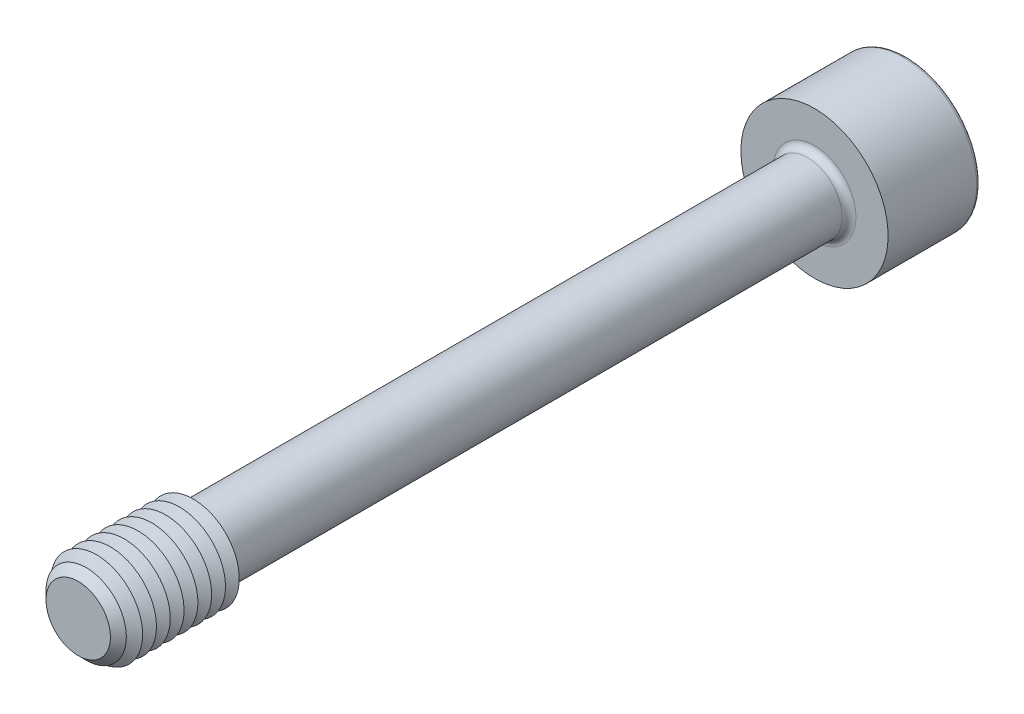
ISO-10303-21;
HEADER;
FILE_DESCRIPTION(('STEP AP214'),'2;1');
FILE_NAME('part.step','',(''),(''),'','','');
FILE_SCHEMA(('AUTOMOTIVE_DESIGN { 1 0 10303 214 1 1 1 1 }'));
ENDSEC;
DATA;
#1=APPLICATION_CONTEXT('core data for automotive mechanical design processes');
#2=APPLICATION_PROTOCOL_DEFINITION('international standard','automotive_design',2000,#1);
#3=PRODUCT_CONTEXT('',#1,'mechanical');
#4=PRODUCT('Part','Part','',(#3));
#5=PRODUCT_RELATED_PRODUCT_CATEGORY('part','',(#4));
#6=PRODUCT_DEFINITION_FORMATION('','',#4);
#7=PRODUCT_DEFINITION_CONTEXT('part definition',#1,'design');
#8=PRODUCT_DEFINITION('design','',#6,#7);
#9=PRODUCT_DEFINITION_SHAPE('','',#8);
#10=(LENGTH_UNIT() NAMED_UNIT(*) SI_UNIT(.MILLI.,.METRE.));
#11=(NAMED_UNIT(*) PLANE_ANGLE_UNIT() SI_UNIT($,.RADIAN.));
#12=(NAMED_UNIT(*) SI_UNIT($,.STERADIAN.) SOLID_ANGLE_UNIT());
#13=UNCERTAINTY_MEASURE_WITH_UNIT(LENGTH_MEASURE(1.E-05),#10,'distance_accuracy_value','');
#14=(GEOMETRIC_REPRESENTATION_CONTEXT(3) GLOBAL_UNCERTAINTY_ASSIGNED_CONTEXT((#13)) GLOBAL_UNIT_ASSIGNED_CONTEXT((#10,
#11,#12)) REPRESENTATION_CONTEXT('',''));
#15=CARTESIAN_POINT('',(0.,0.,0.));
#16=DIRECTION('',(0.,0.,1.));
#17=DIRECTION('',(1.,0.,0.));
#18=AXIS2_PLACEMENT_3D('',#15,#16,#17);
#19=CARTESIAN_POINT('',(-2.3094010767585,-4.,-42.));
#20=DIRECTION('',(0.,0.,1.));
#21=DIRECTION('',(1.,0.,0.));
#22=AXIS2_PLACEMENT_3D('',#19,#20,#21);
#23=PLANE('',#22);
#24=DIRECTION('',(1.,0.,0.));
#25=VECTOR('',#24,1.);
#26=CARTESIAN_POINT('',(-2.3094010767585,-4.,-42.));
#27=LINE('',#26,#25);
#28=CARTESIAN_POINT('',(0.,-4.,-42.));
#29=VERTEX_POINT('',#28);
#30=CARTESIAN_POINT('',(2.3094010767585,-4.,-42.));
#31=VERTEX_POINT('',#30);
#32=EDGE_CURVE('E762',#29,#31,#27,.T.);
#33=ORIENTED_EDGE('',*,*,#32,.F.);
#34=CARTESIAN_POINT('',(0.,0.,-42.));
#35=DIRECTION('',(0.,0.,1.));
#36=DIRECTION('',(0.,-1.,0.));
#37=AXIS2_PLACEMENT_3D('',#34,#35,#36);
#38=CIRCLE('',#37,4.);
#39=CARTESIAN_POINT('',(3.46410161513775,-2.,-42.));
#40=VERTEX_POINT('',#39);
#41=EDGE_CURVE('E53',#29,#40,#38,.T.);
#42=ORIENTED_EDGE('',*,*,#41,.T.);
#43=DIRECTION('',(0.5,0.866025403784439,0.));
#44=VECTOR('',#43,1.);
#45=CARTESIAN_POINT('',(2.3094010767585,-4.,-42.));
#46=LINE('',#45,#44);
#47=EDGE_CURVE('E746',#31,#40,#46,.T.);
#48=ORIENTED_EDGE('',*,*,#47,.F.);
#49=EDGE_LOOP('',(#33,#42,#48));
#50=FACE_BOUND('',#49,.T.);
#51=ADVANCED_FACE('F41',(#50),#23,.F.);
#52=CARTESIAN_POINT('',(4.618802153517,0.,-42.));
#53=VERTEX_POINT('',#52);
#54=EDGE_CURVE('E758',#40,#53,#46,.T.);
#55=ORIENTED_EDGE('',*,*,#54,.F.);
#56=CARTESIAN_POINT('',(3.46410161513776,2.,-42.));
#57=VERTEX_POINT('',#56);
#58=EDGE_CURVE('E11',#40,#57,#38,.T.);
#59=ORIENTED_EDGE('',*,*,#58,.T.);
#60=DIRECTION('',(-0.5,0.866025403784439,0.));
#61=VECTOR('',#60,1.);
#62=CARTESIAN_POINT('',(4.618802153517,0.,-42.));
#63=LINE('',#62,#61);
#64=EDGE_CURVE('E745',#53,#57,#63,.T.);
#65=ORIENTED_EDGE('',*,*,#64,.F.);
#66=EDGE_LOOP('',(#55,#59,#65));
#67=FACE_BOUND('',#66,.T.);
#68=ADVANCED_FACE('F133',(#67),#23,.F.);
#69=CARTESIAN_POINT('',(2.3094010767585,4.,-42.));
#70=VERTEX_POINT('',#69);
#71=EDGE_CURVE('E740',#57,#70,#63,.T.);
#72=ORIENTED_EDGE('',*,*,#71,.F.);
#73=CARTESIAN_POINT('',(0.,4.,-42.));
#74=VERTEX_POINT('',#73);
#75=EDGE_CURVE('E51',#57,#74,#38,.T.);
#76=ORIENTED_EDGE('',*,*,#75,.T.);
#77=DIRECTION('',(-1.,0.,0.));
#78=VECTOR('',#77,1.);
#79=CARTESIAN_POINT('',(2.3094010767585,4.,-42.));
#80=LINE('',#79,#78);
#81=EDGE_CURVE('E177',#70,#74,#80,.T.);
#82=ORIENTED_EDGE('',*,*,#81,.F.);
#83=EDGE_LOOP('',(#72,#76,#82));
#84=FACE_BOUND('',#83,.T.);
#85=ADVANCED_FACE('F139',(#84),#23,.F.);
#86=CARTESIAN_POINT('',(-2.3094010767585,4.,-42.));
#87=VERTEX_POINT('',#86);
#88=EDGE_CURVE('E751',#74,#87,#80,.T.);
#89=ORIENTED_EDGE('',*,*,#88,.F.);
#90=CARTESIAN_POINT('',(-3.46410161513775,2.,-42.));
#91=VERTEX_POINT('',#90);
#92=EDGE_CURVE('E262',#74,#91,#38,.T.);
#93=ORIENTED_EDGE('',*,*,#92,.T.);
#94=DIRECTION('',(-0.500000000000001,-0.866025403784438,0.));
#95=VECTOR('',#94,1.);
#96=CARTESIAN_POINT('',(-2.3094010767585,4.,-42.));
#97=LINE('',#96,#95);
#98=EDGE_CURVE('E176',#87,#91,#97,.T.);
#99=ORIENTED_EDGE('',*,*,#98,.F.);
#100=EDGE_LOOP('',(#89,#93,#99));
#101=FACE_BOUND('',#100,.T.);
#102=ADVANCED_FACE('F157',(#101),#23,.F.);
#103=CARTESIAN_POINT('',(-4.61880215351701,0.,-42.));
#104=VERTEX_POINT('',#103);
#105=EDGE_CURVE('E170',#91,#104,#97,.T.);
#106=ORIENTED_EDGE('',*,*,#105,.F.);
#107=CARTESIAN_POINT('',(-3.46410161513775,-2.,-42.));
#108=VERTEX_POINT('',#107);
#109=EDGE_CURVE('E172',#91,#108,#38,.T.);
#110=ORIENTED_EDGE('',*,*,#109,.T.);
#111=DIRECTION('',(0.5,-0.866025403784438,0.));
#112=VECTOR('',#111,1.);
#113=CARTESIAN_POINT('',(-4.61880215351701,0.,-42.));
#114=LINE('',#113,#112);
#115=EDGE_CURVE('E174',#104,#108,#114,.T.);
#116=ORIENTED_EDGE('',*,*,#115,.F.);
#117=EDGE_LOOP('',(#106,#110,#116));
#118=FACE_BOUND('',#117,.T.);
#119=ADVANCED_FACE('F146',(#118),#23,.F.);
#120=CARTESIAN_POINT('',(0.,0.,-50.));
#121=DIRECTION('',(0.,0.,-1.));
#122=DIRECTION('',(-1.,0.,0.));
#123=AXIS2_PLACEMENT_3D('',#120,#121,#122);
#124=PLANE('',#123);
#125=CARTESIAN_POINT('',(0.,0.,-50.));
#126=DIRECTION('',(0.,0.,-1.));
#127=DIRECTION('',(-1.,0.,0.));
#128=AXIS2_PLACEMENT_3D('',#125,#126,#127);
#129=CIRCLE('',#128,7.625);
#130=CARTESIAN_POINT('',(-7.625,0.,-50.));
#131=VERTEX_POINT('',#130);
#132=EDGE_CURVE('E250',#131,#131,#129,.T.);
#133=ORIENTED_EDGE('',*,*,#132,.T.);
#134=EDGE_LOOP('',(#133));
#135=FACE_BOUND('',#134,.T.);
#136=DIRECTION('',(-0.500000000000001,-0.866025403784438,0.));
#137=VECTOR('',#136,1.);
#138=CARTESIAN_POINT('',(-2.3094010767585,4.,-50.));
#139=LINE('',#138,#137);
#140=CARTESIAN_POINT('',(-2.3094010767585,4.,-50.));
#141=VERTEX_POINT('',#140);
#142=CARTESIAN_POINT('',(-4.61880215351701,0.,-50.));
#143=VERTEX_POINT('',#142);
#144=EDGE_CURVE('E211',#141,#143,#139,.T.);
#145=ORIENTED_EDGE('',*,*,#144,.T.);
#146=DIRECTION('',(0.5,-0.866025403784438,0.));
#147=VECTOR('',#146,1.);
#148=CARTESIAN_POINT('',(-4.61880215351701,0.,-50.));
#149=LINE('',#148,#147);
#150=CARTESIAN_POINT('',(-2.3094010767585,-4.,-50.));
#151=VERTEX_POINT('',#150);
#152=EDGE_CURVE('E67',#143,#151,#149,.T.);
#153=ORIENTED_EDGE('',*,*,#152,.T.);
#154=DIRECTION('',(1.,0.,0.));
#155=VECTOR('',#154,1.);
#156=CARTESIAN_POINT('',(-2.3094010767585,-4.,-50.));
#157=LINE('',#156,#155);
#158=CARTESIAN_POINT('',(2.3094010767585,-4.,-50.));
#159=VERTEX_POINT('',#158);
#160=EDGE_CURVE('E196',#151,#159,#157,.T.);
#161=ORIENTED_EDGE('',*,*,#160,.T.);
#162=DIRECTION('',(0.5,0.866025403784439,0.));
#163=VECTOR('',#162,1.);
#164=CARTESIAN_POINT('',(2.3094010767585,-4.,-50.));
#165=LINE('',#164,#163);
#166=CARTESIAN_POINT('',(4.618802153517,0.,-50.));
#167=VERTEX_POINT('',#166);
#168=EDGE_CURVE('E200',#159,#167,#165,.T.);
#169=ORIENTED_EDGE('',*,*,#168,.T.);
#170=DIRECTION('',(-0.5,0.866025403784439,0.));
#171=VECTOR('',#170,1.);
#172=CARTESIAN_POINT('',(4.618802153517,0.,-50.));
#173=LINE('',#172,#171);
#174=CARTESIAN_POINT('',(2.3094010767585,4.,-50.));
#175=VERTEX_POINT('',#174);
#176=EDGE_CURVE('E204',#167,#175,#173,.T.);
#177=ORIENTED_EDGE('',*,*,#176,.T.);
#178=DIRECTION('',(-1.,0.,0.));
#179=VECTOR('',#178,1.);
#180=CARTESIAN_POINT('',(2.3094010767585,4.,-50.));
#181=LINE('',#180,#179);
#182=EDGE_CURVE('E207',#175,#141,#181,.T.);
#183=ORIENTED_EDGE('',*,*,#182,.T.);
#184=EDGE_LOOP('',(#145,#153,#161,#169,#177,#183));
#185=FACE_BOUND('',#184,.T.);
#186=ADVANCED_FACE('F156',(#135,#185),#124,.T.);
#187=CARTESIAN_POINT('',(0.,0.,40.));
#188=DIRECTION('',(0.,0.,-1.));
#189=DIRECTION('',(-1.,0.,0.));
#190=AXIS2_PLACEMENT_3D('',#187,#188,#189);
#191=CYLINDRICAL_SURFACE('',#190,3.75);
#192=CARTESIAN_POINT('',(0.,0.,-39.25));
#193=DIRECTION('',(0.,0.,-1.));
#194=DIRECTION('',(-1.,0.,0.));
#195=AXIS2_PLACEMENT_3D('',#192,#193,#194);
#196=CIRCLE('',#195,3.75);
#197=CARTESIAN_POINT('',(-3.75,0.,-39.25));
#198=VERTEX_POINT('',#197);
#199=EDGE_CURVE('E246',#198,#198,#196,.F.);
#200=ORIENTED_EDGE('',*,*,#199,.T.);
#201=EDGE_LOOP('',(#200));
#202=FACE_BOUND('',#201,.T.);
#203=CARTESIAN_POINT('',(0.,0.,26.778312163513));
#204=DIRECTION('',(0.,0.,-1.));
#205=DIRECTION('',(0.,1.,0.));
#206=AXIS2_PLACEMENT_3D('',#203,#204,#205);
#207=CIRCLE('',#206,3.75);
#208=CARTESIAN_POINT('',(0.,3.75,26.778312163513));
#209=VERTEX_POINT('',#208);
#210=EDGE_CURVE('E234',#209,#209,#207,.T.);
#211=ORIENTED_EDGE('',*,*,#210,.T.);
#212=EDGE_LOOP('',(#211));
#213=FACE_BOUND('',#212,.T.);
#214=ADVANCED_FACE('F163',(#202,#213),#191,.T.);
#215=CARTESIAN_POINT('',(0.,0.,26.778312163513));
#216=DIRECTION('',(0.,0.,1.));
#217=DIRECTION('',(0.,-1.,0.));
#218=AXIS2_PLACEMENT_3D('',#215,#216,#217);
#219=CONICAL_SURFACE('',#218,3.75,1.0471975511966);
#220=CARTESIAN_POINT('',(0.,0.,27.5));
#221=DIRECTION('',(0.,0.,-1.));
#222=DIRECTION('',(-1.,0.,0.));
#223=AXIS2_PLACEMENT_3D('',#220,#221,#222);
#224=CIRCLE('',#223,5.);
#225=CARTESIAN_POINT('',(-5.,0.,27.5));
#226=VERTEX_POINT('',#225);
#227=EDGE_CURVE('E266',#226,#226,#224,.T.);
#228=ORIENTED_EDGE('',*,*,#227,.T.);
#229=EDGE_LOOP('',(#228));
#230=FACE_BOUND('',#229,.T.);
#231=ORIENTED_EDGE('',*,*,#210,.F.);
#232=EDGE_LOOP('',(#231));
#233=FACE_BOUND('',#232,.T.);
#234=ADVANCED_FACE('F509',(#230,#233),#219,.T.);
#235=CARTESIAN_POINT('',(0.,0.,-40.));
#236=DIRECTION('',(0.,0.,-1.));
#237=DIRECTION('',(-1.,0.,0.));
#238=AXIS2_PLACEMENT_3D('',#235,#236,#237);
#239=PLANE('',#238);
#240=CARTESIAN_POINT('',(0.,0.,-40.));
#241=DIRECTION('',(0.,0.,-1.));
#242=DIRECTION('',(-1.,0.,0.));
#243=AXIS2_PLACEMENT_3D('',#240,#241,#242);
#244=CIRCLE('',#243,4.5);
#245=CARTESIAN_POINT('',(-4.5,0.,-40.));
#246=VERTEX_POINT('',#245);
#247=EDGE_CURVE('E242',#246,#246,#244,.T.);
#248=ORIENTED_EDGE('',*,*,#247,.T.);
#249=EDGE_LOOP('',(#248));
#250=FACE_BOUND('',#249,.T.);
#251=CARTESIAN_POINT('',(0.,0.,-40.));
#252=DIRECTION('',(0.,0.,-1.));
#253=DIRECTION('',(-1.,0.,0.));
#254=AXIS2_PLACEMENT_3D('',#251,#252,#253);
#255=CIRCLE('',#254,8.);
#256=CARTESIAN_POINT('',(-8.,0.,-40.));
#257=VERTEX_POINT('',#256);
#258=EDGE_CURVE('E230',#257,#257,#255,.T.);
#259=ORIENTED_EDGE('',*,*,#258,.F.);
#260=EDGE_LOOP('',(#259));
#261=FACE_BOUND('',#260,.T.);
#262=ADVANCED_FACE('F502',(#250,#261),#239,.F.);
#263=CARTESIAN_POINT('',(0.,0.,-50.));
#264=DIRECTION('',(0.,0.,1.));
#265=DIRECTION('',(1.,0.,0.));
#266=AXIS2_PLACEMENT_3D('',#263,#264,#265);
#267=CYLINDRICAL_SURFACE('',#266,8.);
#268=CARTESIAN_POINT('',(0.,0.,-49.625));
#269=DIRECTION('',(0.,0.,-1.));
#270=DIRECTION('',(-1.,0.,0.));
#271=AXIS2_PLACEMENT_3D('',#268,#269,#270);
#272=CIRCLE('',#271,8.);
#273=CARTESIAN_POINT('',(-8.,0.,-49.625));
#274=VERTEX_POINT('',#273);
#275=EDGE_CURVE('E252',#274,#274,#272,.F.);
#276=ORIENTED_EDGE('',*,*,#275,.T.);
#277=EDGE_LOOP('',(#276));
#278=FACE_BOUND('',#277,.T.);
#279=ORIENTED_EDGE('',*,*,#258,.T.);
#280=EDGE_LOOP('',(#279));
#281=FACE_BOUND('',#280,.T.);
#282=ADVANCED_FACE('F508',(#278,#281),#267,.T.);
#283=CARTESIAN_POINT('',(-4.61880215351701,0.,-42.));
#284=DIRECTION('',(0.866025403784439,0.5,0.));
#285=DIRECTION('',(-0.5,0.866025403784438,0.));
#286=AXIS2_PLACEMENT_3D('',#283,#284,#285);
#287=PLANE('',#286);
#288=ORIENTED_EDGE('',*,*,#152,.F.);
#289=DIRECTION('',(0.,0.,-1.));
#290=VECTOR('',#289,1.);
#291=CARTESIAN_POINT('',(-4.61880215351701,0.,-42.));
#292=LINE('',#291,#290);
#293=EDGE_CURVE('E186',#104,#143,#292,.T.);
#294=ORIENTED_EDGE('',*,*,#293,.F.);
#295=ORIENTED_EDGE('',*,*,#115,.T.);
#296=CARTESIAN_POINT('',(-2.3094010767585,-4.,-42.));
#297=VERTEX_POINT('',#296);
#298=EDGE_CURVE('E214',#108,#297,#114,.T.);
#299=ORIENTED_EDGE('',*,*,#298,.T.);
#300=DIRECTION('',(0.,0.,-1.));
#301=VECTOR('',#300,1.);
#302=CARTESIAN_POINT('',(-2.3094010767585,-4.,-42.));
#303=LINE('',#302,#301);
#304=EDGE_CURVE('E227',#297,#151,#303,.T.);
#305=ORIENTED_EDGE('',*,*,#304,.T.);
#306=EDGE_LOOP('',(#288,#294,#295,#299,#305));
#307=FACE_BOUND('',#306,.T.);
#308=ADVANCED_FACE('F520',(#307),#287,.T.);
#309=CARTESIAN_POINT('',(-2.3094010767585,-4.,-42.));
#310=DIRECTION('',(0.,1.,0.));
#311=DIRECTION('',(-1.,0.,0.));
#312=AXIS2_PLACEMENT_3D('',#309,#310,#311);
#313=PLANE('',#312);
#314=ORIENTED_EDGE('',*,*,#160,.F.);
#315=ORIENTED_EDGE('',*,*,#304,.F.);
#316=EDGE_CURVE('E759',#297,#29,#27,.T.);
#317=ORIENTED_EDGE('',*,*,#316,.T.);
#318=ORIENTED_EDGE('',*,*,#32,.T.);
#319=DIRECTION('',(0.,0.,-1.));
#320=VECTOR('',#319,1.);
#321=CARTESIAN_POINT('',(2.3094010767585,-4.,-42.));
#322=LINE('',#321,#320);
#323=EDGE_CURVE('E224',#31,#159,#322,.T.);
#324=ORIENTED_EDGE('',*,*,#323,.T.);
#325=EDGE_LOOP('',(#314,#315,#317,#318,#324));
#326=FACE_BOUND('',#325,.T.);
#327=ADVANCED_FACE('F536',(#326),#313,.T.);
#328=CARTESIAN_POINT('',(2.3094010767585,-4.,-42.));
#329=DIRECTION('',(-0.866025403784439,0.5,0.));
#330=DIRECTION('',(-0.5,-0.866025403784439,0.));
#331=AXIS2_PLACEMENT_3D('',#328,#329,#330);
#332=PLANE('',#331);
#333=ORIENTED_EDGE('',*,*,#168,.F.);
#334=ORIENTED_EDGE('',*,*,#323,.F.);
#335=ORIENTED_EDGE('',*,*,#47,.T.);
#336=ORIENTED_EDGE('',*,*,#54,.T.);
#337=DIRECTION('',(0.,0.,-1.));
#338=VECTOR('',#337,1.);
#339=CARTESIAN_POINT('',(4.618802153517,0.,-42.));
#340=LINE('',#339,#338);
#341=EDGE_CURVE('E221',#53,#167,#340,.T.);
#342=ORIENTED_EDGE('',*,*,#341,.T.);
#343=EDGE_LOOP('',(#333,#334,#335,#336,#342));
#344=FACE_BOUND('',#343,.T.);
#345=ADVANCED_FACE('F546',(#344),#332,.T.);
#346=CARTESIAN_POINT('',(4.618802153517,0.,-42.));
#347=DIRECTION('',(-0.866025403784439,-0.5,0.));
#348=DIRECTION('',(0.5,-0.866025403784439,0.));
#349=AXIS2_PLACEMENT_3D('',#346,#347,#348);
#350=PLANE('',#349);
#351=ORIENTED_EDGE('',*,*,#176,.F.);
#352=ORIENTED_EDGE('',*,*,#341,.F.);
#353=ORIENTED_EDGE('',*,*,#64,.T.);
#354=ORIENTED_EDGE('',*,*,#71,.T.);
#355=DIRECTION('',(0.,0.,-1.));
#356=VECTOR('',#355,1.);
#357=CARTESIAN_POINT('',(2.3094010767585,4.,-42.));
#358=LINE('',#357,#356);
#359=EDGE_CURVE('E218',#70,#175,#358,.T.);
#360=ORIENTED_EDGE('',*,*,#359,.T.);
#361=EDGE_LOOP('',(#351,#352,#353,#354,#360));
#362=FACE_BOUND('',#361,.T.);
#363=ADVANCED_FACE('F556',(#362),#350,.T.);
#364=CARTESIAN_POINT('',(2.3094010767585,4.,-42.));
#365=DIRECTION('',(0.,-1.,0.));
#366=DIRECTION('',(0.,0.,-1.));
#367=AXIS2_PLACEMENT_3D('',#364,#365,#366);
#368=PLANE('',#367);
#369=ORIENTED_EDGE('',*,*,#182,.F.);
#370=ORIENTED_EDGE('',*,*,#359,.F.);
#371=ORIENTED_EDGE('',*,*,#81,.T.);
#372=ORIENTED_EDGE('',*,*,#88,.T.);
#373=DIRECTION('',(0.,0.,-1.));
#374=VECTOR('',#373,1.);
#375=CARTESIAN_POINT('',(-2.3094010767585,4.,-42.));
#376=LINE('',#375,#374);
#377=EDGE_CURVE('E182',#87,#141,#376,.T.);
#378=ORIENTED_EDGE('',*,*,#377,.T.);
#379=EDGE_LOOP('',(#369,#370,#371,#372,#378));
#380=FACE_BOUND('',#379,.T.);
#381=ADVANCED_FACE('F152',(#380),#368,.T.);
#382=CARTESIAN_POINT('',(-2.3094010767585,4.,-42.));
#383=DIRECTION('',(0.866025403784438,-0.500000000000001,0.));
#384=DIRECTION('',(0.500000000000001,0.866025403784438,0.));
#385=AXIS2_PLACEMENT_3D('',#382,#383,#384);
#386=PLANE('',#385);
#387=ORIENTED_EDGE('',*,*,#144,.F.);
#388=ORIENTED_EDGE('',*,*,#377,.F.);
#389=ORIENTED_EDGE('',*,*,#98,.T.);
#390=ORIENTED_EDGE('',*,*,#105,.T.);
#391=ORIENTED_EDGE('',*,*,#293,.T.);
#392=EDGE_LOOP('',(#387,#388,#389,#390,#391));
#393=FACE_BOUND('',#392,.T.);
#394=ADVANCED_FACE('F144',(#393),#386,.T.);
#395=ORIENTED_EDGE('',*,*,#298,.F.);
#396=EDGE_CURVE('E255',#108,#29,#38,.T.);
#397=ORIENTED_EDGE('',*,*,#396,.T.);
#398=ORIENTED_EDGE('',*,*,#316,.F.);
#399=EDGE_LOOP('',(#395,#397,#398));
#400=FACE_BOUND('',#399,.T.);
#401=ADVANCED_FACE('F135',(#400),#23,.F.);
#402=CARTESIAN_POINT('',(0.,0.,-39.25));
#403=DIRECTION('',(0.,0.,-1.));
#404=DIRECTION('',(-1.,0.,0.));
#405=AXIS2_PLACEMENT_3D('',#402,#403,#404);
#406=TOROIDAL_SURFACE('',#405,4.5,0.75);
#407=ORIENTED_EDGE('',*,*,#199,.F.);
#408=EDGE_LOOP('',(#407));
#409=FACE_BOUND('',#408,.T.);
#410=ORIENTED_EDGE('',*,*,#247,.F.);
#411=EDGE_LOOP('',(#410));
#412=FACE_BOUND('',#411,.T.);
#413=ADVANCED_FACE('F129',(#409,#412),#406,.F.);
#414=CARTESIAN_POINT('',(0.,0.,-49.625));
#415=DIRECTION('',(0.,0.,-1.));
#416=DIRECTION('',(-1.,0.,0.));
#417=AXIS2_PLACEMENT_3D('',#414,#415,#416);
#418=TOROIDAL_SURFACE('',#417,7.625,0.375);
#419=ORIENTED_EDGE('',*,*,#275,.F.);
#420=EDGE_LOOP('',(#419));
#421=FACE_BOUND('',#420,.T.);
#422=ORIENTED_EDGE('',*,*,#132,.F.);
#423=EDGE_LOOP('',(#422));
#424=FACE_BOUND('',#423,.T.);
#425=ADVANCED_FACE('F43',(#421,#424),#418,.T.);
#426=CARTESIAN_POINT('',(0.,0.,-39.6905989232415));
#427=DIRECTION('',(0.,0.,-1.));
#428=DIRECTION('',(0.,1.,0.));
#429=AXIS2_PLACEMENT_3D('',#426,#427,#428);
#430=CONICAL_SURFACE('',#429,0.,1.0471975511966);
#431=ORIENTED_EDGE('',*,*,#41,.F.);
#432=ORIENTED_EDGE('',*,*,#396,.F.);
#433=ORIENTED_EDGE('',*,*,#109,.F.);
#434=ORIENTED_EDGE('',*,*,#92,.F.);
#435=ORIENTED_EDGE('',*,*,#75,.F.);
#436=ORIENTED_EDGE('',*,*,#58,.F.);
#437=EDGE_LOOP('',(#431,#432,#433,#434,#435,#436));
#438=FACE_BOUND('',#437,.T.);
#439=CARTESIAN_POINT('',(0.,0.,-39.6905989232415));
#440=VERTEX_POINT('',#439);
#441=VERTEX_LOOP('',#440);
#442=FACE_BOUND('',#441,.T.);
#443=ADVANCED_FACE('F118',(#438,#442),#430,.F.);
#444=CARTESIAN_POINT('',(0.,0.,28.25));
#445=DIRECTION('',(0.,0.,-1.));
#446=DIRECTION('',(-1.,0.,0.));
#447=AXIS2_PLACEMENT_3D('',#444,#445,#446);
#448=CONICAL_SURFACE('',#447,3.70096189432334,1.0471975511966);
#449=ORIENTED_EDGE('',*,*,#227,.F.);
#450=EDGE_LOOP('',(#449));
#451=FACE_BOUND('',#450,.T.);
#452=CARTESIAN_POINT('',(0.,0.,28.25));
#453=DIRECTION('',(0.,0.,-1.));
#454=DIRECTION('',(-1.,0.,0.));
#455=AXIS2_PLACEMENT_3D('',#452,#453,#454);
#456=CIRCLE('',#455,3.70096189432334);
#457=CARTESIAN_POINT('',(-3.70096189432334,0.,28.25));
#458=VERTEX_POINT('',#457);
#459=EDGE_CURVE('E271',#458,#458,#456,.T.);
#460=ORIENTED_EDGE('',*,*,#459,.T.);
#461=EDGE_LOOP('',(#460));
#462=FACE_BOUND('',#461,.T.);
#463=ADVANCED_FACE('F120',(#451,#462),#448,.T.);
#464=CARTESIAN_POINT('',(0.,0.,29.));
#465=DIRECTION('',(0.,0.,1.));
#466=DIRECTION('',(1.,0.,0.));
#467=AXIS2_PLACEMENT_3D('',#464,#465,#466);
#468=CONICAL_SURFACE('',#467,5.,1.0471975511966);
#469=ORIENTED_EDGE('',*,*,#459,.F.);
#470=EDGE_LOOP('',(#469));
#471=FACE_BOUND('',#470,.T.);
#472=CARTESIAN_POINT('',(0.,0.,29.));
#473=DIRECTION('',(0.,0.,-1.));
#474=DIRECTION('',(-1.,0.,0.));
#475=AXIS2_PLACEMENT_3D('',#472,#473,#474);
#476=CIRCLE('',#475,5.);
#477=CARTESIAN_POINT('',(-5.,0.,29.));
#478=VERTEX_POINT('',#477);
#479=EDGE_CURVE('E276',#478,#478,#476,.T.);
#480=ORIENTED_EDGE('',*,*,#479,.T.);
#481=EDGE_LOOP('',(#480));
#482=FACE_BOUND('',#481,.T.);
#483=ADVANCED_FACE('F126',(#471,#482),#468,.T.);
#484=CARTESIAN_POINT('',(0.,0.,29.75));
#485=DIRECTION('',(0.,0.,-1.));
#486=DIRECTION('',(-1.,0.,0.));
#487=AXIS2_PLACEMENT_3D('',#484,#485,#486);
#488=CONICAL_SURFACE('',#487,3.70096189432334,1.0471975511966);
#489=ORIENTED_EDGE('',*,*,#479,.F.);
#490=EDGE_LOOP('',(#489));
#491=FACE_BOUND('',#490,.T.);
#492=CARTESIAN_POINT('',(0.,0.,29.75));
#493=DIRECTION('',(0.,0.,-1.));
#494=DIRECTION('',(-1.,0.,0.));
#495=AXIS2_PLACEMENT_3D('',#492,#493,#494);
#496=CIRCLE('',#495,3.70096189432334);
#497=CARTESIAN_POINT('',(-3.70096189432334,0.,29.75));
#498=VERTEX_POINT('',#497);
#499=EDGE_CURVE('E282',#498,#498,#496,.T.);
#500=ORIENTED_EDGE('',*,*,#499,.T.);
#501=EDGE_LOOP('',(#500));
#502=FACE_BOUND('',#501,.T.);
#503=ADVANCED_FACE('F396',(#491,#502),#488,.T.);
#504=CARTESIAN_POINT('',(0.,0.,30.5));
#505=DIRECTION('',(0.,0.,1.));
#506=DIRECTION('',(1.,0.,0.));
#507=AXIS2_PLACEMENT_3D('',#504,#505,#506);
#508=CONICAL_SURFACE('',#507,5.,1.0471975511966);
#509=ORIENTED_EDGE('',*,*,#499,.F.);
#510=EDGE_LOOP('',(#509));
#511=FACE_BOUND('',#510,.T.);
#512=CARTESIAN_POINT('',(0.,0.,30.5));
#513=DIRECTION('',(0.,0.,-1.));
#514=DIRECTION('',(-1.,0.,0.));
#515=AXIS2_PLACEMENT_3D('',#512,#513,#514);
#516=CIRCLE('',#515,5.);
#517=CARTESIAN_POINT('',(-5.,0.,30.5));
#518=VERTEX_POINT('',#517);
#519=EDGE_CURVE('E286',#518,#518,#516,.T.);
#520=ORIENTED_EDGE('',*,*,#519,.T.);
#521=EDGE_LOOP('',(#520));
#522=FACE_BOUND('',#521,.T.);
#523=ADVANCED_FACE('F392',(#511,#522),#508,.T.);
#524=CARTESIAN_POINT('',(0.,0.,31.25));
#525=DIRECTION('',(0.,0.,-1.));
#526=DIRECTION('',(-1.,0.,0.));
#527=AXIS2_PLACEMENT_3D('',#524,#525,#526);
#528=CONICAL_SURFACE('',#527,3.70096189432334,1.0471975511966);
#529=ORIENTED_EDGE('',*,*,#519,.F.);
#530=EDGE_LOOP('',(#529));
#531=FACE_BOUND('',#530,.T.);
#532=CARTESIAN_POINT('',(0.,0.,31.25));
#533=DIRECTION('',(0.,0.,-1.));
#534=DIRECTION('',(-1.,0.,0.));
#535=AXIS2_PLACEMENT_3D('',#532,#533,#534);
#536=CIRCLE('',#535,3.70096189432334);
#537=CARTESIAN_POINT('',(-3.70096189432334,0.,31.25));
#538=VERTEX_POINT('',#537);
#539=EDGE_CURVE('E290',#538,#538,#536,.T.);
#540=ORIENTED_EDGE('',*,*,#539,.T.);
#541=EDGE_LOOP('',(#540));
#542=FACE_BOUND('',#541,.T.);
#543=ADVANCED_FACE('F388',(#531,#542),#528,.T.);
#544=CARTESIAN_POINT('',(0.,0.,32.));
#545=DIRECTION('',(0.,0.,1.));
#546=DIRECTION('',(1.,0.,0.));
#547=AXIS2_PLACEMENT_3D('',#544,#545,#546);
#548=CONICAL_SURFACE('',#547,5.,1.0471975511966);
#549=ORIENTED_EDGE('',*,*,#539,.F.);
#550=EDGE_LOOP('',(#549));
#551=FACE_BOUND('',#550,.T.);
#552=CARTESIAN_POINT('',(0.,0.,32.));
#553=DIRECTION('',(0.,0.,-1.));
#554=DIRECTION('',(-1.,0.,0.));
#555=AXIS2_PLACEMENT_3D('',#552,#553,#554);
#556=CIRCLE('',#555,5.);
#557=CARTESIAN_POINT('',(-5.,0.,32.));
#558=VERTEX_POINT('',#557);
#559=EDGE_CURVE('E294',#558,#558,#556,.T.);
#560=ORIENTED_EDGE('',*,*,#559,.T.);
#561=EDGE_LOOP('',(#560));
#562=FACE_BOUND('',#561,.T.);
#563=ADVANCED_FACE('F384',(#551,#562),#548,.T.);
#564=CARTESIAN_POINT('',(0.,0.,32.75));
#565=DIRECTION('',(0.,0.,-1.));
#566=DIRECTION('',(-1.,0.,0.));
#567=AXIS2_PLACEMENT_3D('',#564,#565,#566);
#568=CONICAL_SURFACE('',#567,3.70096189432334,1.0471975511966);
#569=ORIENTED_EDGE('',*,*,#559,.F.);
#570=EDGE_LOOP('',(#569));
#571=FACE_BOUND('',#570,.T.);
#572=CARTESIAN_POINT('',(0.,0.,32.75));
#573=DIRECTION('',(0.,0.,-1.));
#574=DIRECTION('',(-1.,0.,0.));
#575=AXIS2_PLACEMENT_3D('',#572,#573,#574);
#576=CIRCLE('',#575,3.70096189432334);
#577=CARTESIAN_POINT('',(-3.70096189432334,0.,32.75));
#578=VERTEX_POINT('',#577);
#579=EDGE_CURVE('E298',#578,#578,#576,.T.);
#580=ORIENTED_EDGE('',*,*,#579,.T.);
#581=EDGE_LOOP('',(#580));
#582=FACE_BOUND('',#581,.T.);
#583=ADVANCED_FACE('F380',(#571,#582),#568,.T.);
#584=CARTESIAN_POINT('',(0.,0.,33.5));
#585=DIRECTION('',(0.,0.,1.));
#586=DIRECTION('',(1.,0.,0.));
#587=AXIS2_PLACEMENT_3D('',#584,#585,#586);
#588=CONICAL_SURFACE('',#587,5.,1.0471975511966);
#589=ORIENTED_EDGE('',*,*,#579,.F.);
#590=EDGE_LOOP('',(#589));
#591=FACE_BOUND('',#590,.T.);
#592=CARTESIAN_POINT('',(0.,0.,33.5));
#593=DIRECTION('',(0.,0.,-1.));
#594=DIRECTION('',(-1.,0.,0.));
#595=AXIS2_PLACEMENT_3D('',#592,#593,#594);
#596=CIRCLE('',#595,5.);
#597=CARTESIAN_POINT('',(-5.,0.,33.5));
#598=VERTEX_POINT('',#597);
#599=EDGE_CURVE('E302',#598,#598,#596,.T.);
#600=ORIENTED_EDGE('',*,*,#599,.T.);
#601=EDGE_LOOP('',(#600));
#602=FACE_BOUND('',#601,.T.);
#603=ADVANCED_FACE('F376',(#591,#602),#588,.T.);
#604=CARTESIAN_POINT('',(0.,0.,34.25));
#605=DIRECTION('',(0.,0.,-1.));
#606=DIRECTION('',(-1.,0.,0.));
#607=AXIS2_PLACEMENT_3D('',#604,#605,#606);
#608=CONICAL_SURFACE('',#607,3.70096189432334,1.0471975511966);
#609=ORIENTED_EDGE('',*,*,#599,.F.);
#610=EDGE_LOOP('',(#609));
#611=FACE_BOUND('',#610,.T.);
#612=CARTESIAN_POINT('',(0.,0.,34.25));
#613=DIRECTION('',(0.,0.,-1.));
#614=DIRECTION('',(-1.,0.,0.));
#615=AXIS2_PLACEMENT_3D('',#612,#613,#614);
#616=CIRCLE('',#615,3.70096189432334);
#617=CARTESIAN_POINT('',(-3.70096189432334,0.,34.25));
#618=VERTEX_POINT('',#617);
#619=EDGE_CURVE('E306',#618,#618,#616,.T.);
#620=ORIENTED_EDGE('',*,*,#619,.T.);
#621=EDGE_LOOP('',(#620));
#622=FACE_BOUND('',#621,.T.);
#623=ADVANCED_FACE('F372',(#611,#622),#608,.T.);
#624=CARTESIAN_POINT('',(0.,0.,35.));
#625=DIRECTION('',(0.,0.,1.));
#626=DIRECTION('',(1.,0.,0.));
#627=AXIS2_PLACEMENT_3D('',#624,#625,#626);
#628=CONICAL_SURFACE('',#627,5.,1.0471975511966);
#629=ORIENTED_EDGE('',*,*,#619,.F.);
#630=EDGE_LOOP('',(#629));
#631=FACE_BOUND('',#630,.T.);
#632=CARTESIAN_POINT('',(0.,0.,35.));
#633=DIRECTION('',(0.,0.,-1.));
#634=DIRECTION('',(-1.,0.,0.));
#635=AXIS2_PLACEMENT_3D('',#632,#633,#634);
#636=CIRCLE('',#635,5.);
#637=CARTESIAN_POINT('',(-5.,0.,35.));
#638=VERTEX_POINT('',#637);
#639=EDGE_CURVE('E310',#638,#638,#636,.T.);
#640=ORIENTED_EDGE('',*,*,#639,.T.);
#641=EDGE_LOOP('',(#640));
#642=FACE_BOUND('',#641,.T.);
#643=ADVANCED_FACE('F368',(#631,#642),#628,.T.);
#644=CARTESIAN_POINT('',(0.,0.,35.75));
#645=DIRECTION('',(0.,0.,-1.));
#646=DIRECTION('',(-1.,0.,0.));
#647=AXIS2_PLACEMENT_3D('',#644,#645,#646);
#648=CONICAL_SURFACE('',#647,3.70096189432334,1.0471975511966);
#649=ORIENTED_EDGE('',*,*,#639,.F.);
#650=EDGE_LOOP('',(#649));
#651=FACE_BOUND('',#650,.T.);
#652=CARTESIAN_POINT('',(0.,0.,35.75));
#653=DIRECTION('',(0.,0.,-1.));
#654=DIRECTION('',(-1.,0.,0.));
#655=AXIS2_PLACEMENT_3D('',#652,#653,#654);
#656=CIRCLE('',#655,3.70096189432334);
#657=CARTESIAN_POINT('',(-3.70096189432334,0.,35.75));
#658=VERTEX_POINT('',#657);
#659=EDGE_CURVE('E314',#658,#658,#656,.T.);
#660=ORIENTED_EDGE('',*,*,#659,.T.);
#661=EDGE_LOOP('',(#660));
#662=FACE_BOUND('',#661,.T.);
#663=ADVANCED_FACE('F364',(#651,#662),#648,.T.);
#664=CARTESIAN_POINT('',(0.,0.,36.5));
#665=DIRECTION('',(0.,0.,1.));
#666=DIRECTION('',(1.,0.,0.));
#667=AXIS2_PLACEMENT_3D('',#664,#665,#666);
#668=CONICAL_SURFACE('',#667,5.,1.0471975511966);
#669=ORIENTED_EDGE('',*,*,#659,.F.);
#670=EDGE_LOOP('',(#669));
#671=FACE_BOUND('',#670,.T.);
#672=CARTESIAN_POINT('',(0.,0.,36.5));
#673=DIRECTION('',(0.,0.,-1.));
#674=DIRECTION('',(-1.,0.,0.));
#675=AXIS2_PLACEMENT_3D('',#672,#673,#674);
#676=CIRCLE('',#675,5.);
#677=CARTESIAN_POINT('',(-5.,0.,36.5));
#678=VERTEX_POINT('',#677);
#679=EDGE_CURVE('E318',#678,#678,#676,.T.);
#680=ORIENTED_EDGE('',*,*,#679,.T.);
#681=EDGE_LOOP('',(#680));
#682=FACE_BOUND('',#681,.T.);
#683=ADVANCED_FACE('F360',(#671,#682),#668,.T.);
#684=CARTESIAN_POINT('',(0.,0.,37.25));
#685=DIRECTION('',(0.,0.,-1.));
#686=DIRECTION('',(-1.,0.,0.));
#687=AXIS2_PLACEMENT_3D('',#684,#685,#686);
#688=CONICAL_SURFACE('',#687,3.70096189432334,1.0471975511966);
#689=ORIENTED_EDGE('',*,*,#679,.F.);
#690=EDGE_LOOP('',(#689));
#691=FACE_BOUND('',#690,.T.);
#692=CARTESIAN_POINT('',(0.,0.,37.25));
#693=DIRECTION('',(0.,0.,-1.));
#694=DIRECTION('',(-1.,0.,0.));
#695=AXIS2_PLACEMENT_3D('',#692,#693,#694);
#696=CIRCLE('',#695,3.70096189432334);
#697=CARTESIAN_POINT('',(-3.70096189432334,0.,37.25));
#698=VERTEX_POINT('',#697);
#699=EDGE_CURVE('E322',#698,#698,#696,.T.);
#700=ORIENTED_EDGE('',*,*,#699,.T.);
#701=EDGE_LOOP('',(#700));
#702=FACE_BOUND('',#701,.T.);
#703=ADVANCED_FACE('F356',(#691,#702),#688,.T.);
#704=CARTESIAN_POINT('',(0.,0.,38.));
#705=DIRECTION('',(0.,0.,1.));
#706=DIRECTION('',(1.,0.,0.));
#707=AXIS2_PLACEMENT_3D('',#704,#705,#706);
#708=CONICAL_SURFACE('',#707,5.,1.0471975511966);
#709=ORIENTED_EDGE('',*,*,#699,.F.);
#710=EDGE_LOOP('',(#709));
#711=FACE_BOUND('',#710,.T.);
#712=CARTESIAN_POINT('',(0.,0.,38.));
#713=DIRECTION('',(0.,0.,-1.));
#714=DIRECTION('',(-1.,0.,0.));
#715=AXIS2_PLACEMENT_3D('',#712,#713,#714);
#716=CIRCLE('',#715,5.);
#717=CARTESIAN_POINT('',(-5.,0.,38.));
#718=VERTEX_POINT('',#717);
#719=EDGE_CURVE('E326',#718,#718,#716,.T.);
#720=ORIENTED_EDGE('',*,*,#719,.T.);
#721=EDGE_LOOP('',(#720));
#722=FACE_BOUND('',#721,.T.);
#723=ADVANCED_FACE('F349',(#711,#722),#708,.T.);
#724=CARTESIAN_POINT('',(0.,0.,38.75));
#725=DIRECTION('',(0.,0.,-1.));
#726=DIRECTION('',(-1.,0.,0.));
#727=AXIS2_PLACEMENT_3D('',#724,#725,#726);
#728=CONICAL_SURFACE('',#727,3.70096189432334,1.0471975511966);
#729=ORIENTED_EDGE('',*,*,#719,.F.);
#730=EDGE_LOOP('',(#729));
#731=FACE_BOUND('',#730,.T.);
#732=CARTESIAN_POINT('',(0.,0.,38.75));
#733=DIRECTION('',(0.,0.,-1.));
#734=DIRECTION('',(-1.,0.,0.));
#735=AXIS2_PLACEMENT_3D('',#732,#733,#734);
#736=CIRCLE('',#735,3.70096189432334);
#737=CARTESIAN_POINT('',(-3.70096189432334,0.,38.75));
#738=VERTEX_POINT('',#737);
#739=EDGE_CURVE('E330',#738,#738,#736,.T.);
#740=ORIENTED_EDGE('',*,*,#739,.T.);
#741=EDGE_LOOP('',(#740));
#742=FACE_BOUND('',#741,.T.);
#743=ADVANCED_FACE('F335',(#731,#742),#728,.T.);
#744=CARTESIAN_POINT('',(0.,0.,39.5));
#745=DIRECTION('',(0.,0.,1.));
#746=DIRECTION('',(1.,0.,0.));
#747=AXIS2_PLACEMENT_3D('',#744,#745,#746);
#748=CONICAL_SURFACE('',#747,5.,1.0471975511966);
#749=CARTESIAN_POINT('',(0.,0.,39.1339745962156));
#750=DIRECTION('',(0.,0.,1.));
#751=DIRECTION('',(1.,0.,0.));
#752=AXIS2_PLACEMENT_3D('',#749,#750,#751);
#753=CIRCLE('',#752,4.36602540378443);
#754=CARTESIAN_POINT('',(4.36602540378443,0.,39.1339745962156));
#755=VERTEX_POINT('',#754);
#756=EDGE_CURVE('E45',#755,#755,#753,.F.);
#757=ORIENTED_EDGE('',*,*,#756,.T.);
#758=EDGE_LOOP('',(#757));
#759=FACE_BOUND('',#758,.T.);
#760=ORIENTED_EDGE('',*,*,#739,.F.);
#761=EDGE_LOOP('',(#760));
#762=FACE_BOUND('',#761,.T.);
#763=ADVANCED_FACE('F337',(#759,#762),#748,.T.);
#764=CARTESIAN_POINT('',(0.,0.,40.));
#765=DIRECTION('',(0.,0.,1.));
#766=DIRECTION('',(1.,0.,0.));
#767=AXIS2_PLACEMENT_3D('',#764,#765,#766);
#768=PLANE('',#767);
#769=CARTESIAN_POINT('',(0.,0.,40.));
#770=DIRECTION('',(0.,0.,1.));
#771=DIRECTION('',(1.,0.,0.));
#772=AXIS2_PLACEMENT_3D('',#769,#770,#771);
#773=CIRCLE('',#772,3.49999999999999);
#774=CARTESIAN_POINT('',(3.49999999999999,0.,40.));
#775=VERTEX_POINT('',#774);
#776=EDGE_CURVE('E238',#775,#775,#773,.T.);
#777=ORIENTED_EDGE('',*,*,#776,.T.);
#778=EDGE_LOOP('',(#777));
#779=FACE_BOUND('',#778,.T.);
#780=ADVANCED_FACE('F339',(#779),#768,.T.);
#781=CARTESIAN_POINT('',(0.,0.,38.5));
#782=DIRECTION('',(0.,0.,-1.));
#783=DIRECTION('',(0.,1.,0.));
#784=AXIS2_PLACEMENT_3D('',#781,#782,#783);
#785=CONICAL_SURFACE('',#784,5.,0.785398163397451);
#786=ORIENTED_EDGE('',*,*,#756,.F.);
#787=EDGE_LOOP('',(#786));
#788=FACE_BOUND('',#787,.T.);
#789=ORIENTED_EDGE('',*,*,#776,.F.);
#790=EDGE_LOOP('',(#789));
#791=FACE_BOUND('',#790,.T.);
#792=ADVANCED_FACE('F346',(#788,#791),#785,.T.);
#793=CLOSED_SHELL('',(#51,#68,#85,#102,#119,#186,#214,#234,#262,#282,#308,#327,#345,#363,#381,
#394,#401,#413,#425,#443,#463,#483,#503,#523,#543,#563,#583,#603,#623,#643,#663,#683,#703,#723,
#743,#763,#780,#792));
#794=MANIFOLD_SOLID_BREP('B2',#793);
#795=ADVANCED_BREP_SHAPE_REPRESENTATION('',(#18,#794),#14);
#796=SHAPE_DEFINITION_REPRESENTATION(#9,#795);
ENDSEC;
END-ISO-10303-21;
